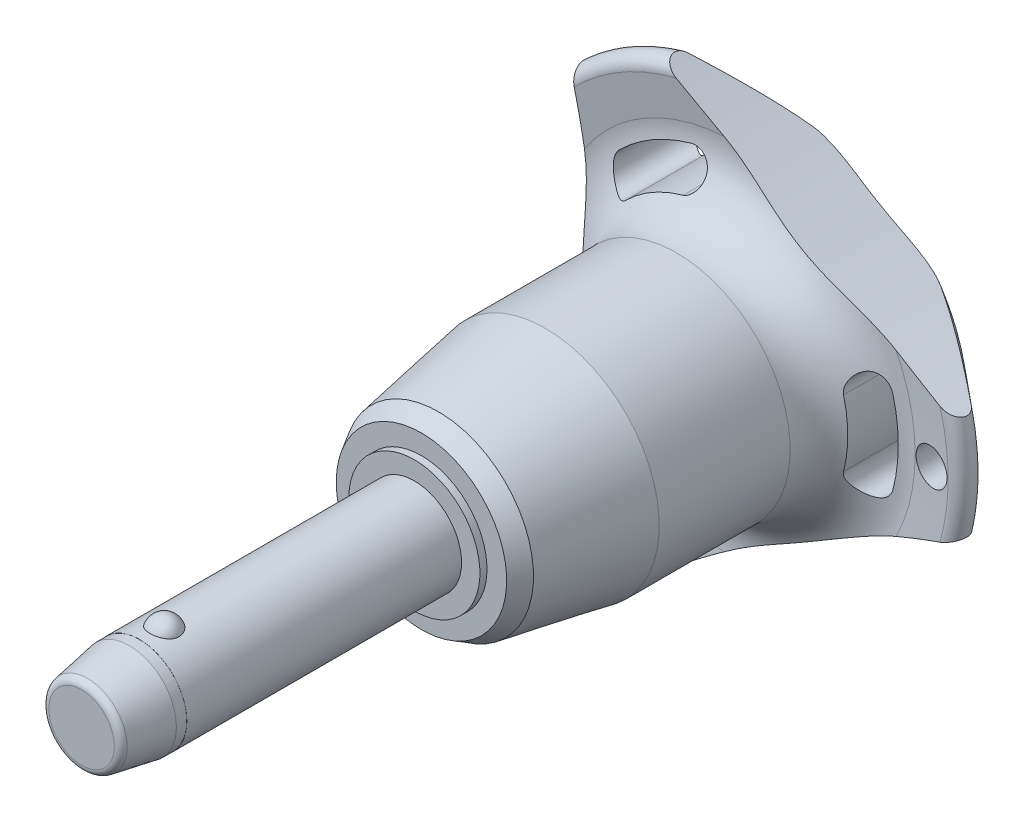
from build123d import *

# Parameters (mm, degrees)
SKETCH1_R           = 4
BOSS_EXTRUDE1_DEPTH = 20
SKETCH2_R           = 3.4
BOSS_EXTRUDE2_DEPTH = 33.3
BOSS_EXTRUDE3_START = 8.2
SKETCH1_2_R         = 4
BOSS_EXTRUDE3_DEPTH = 8.2
CHAMFER1_SIZE       = 4.1
CHAMFER1_SIZE2      = 0.722940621
FILLET1_R           = 0.6
SKETCH6_R           = 102.8
CUT_EXTRUDE1_DEPTH  = 61.079897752
CIRPATTERN1_COUNT   = 3
SKETCH7_R           = 1.5
CUT_EXTRUDE2_DEPTH  = 60.810087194
SKETCH8_R           = 4
SKETCH8_R_2         = 3.99
CUT_EXTRUDE3_DEPTH  = 4.92


with BuildPart() as part:
    # Sketch1 → Boss-Extrude1 (new body)
    with BuildSketch(Plane.XY):
        Circle(SKETCH1_R)
    extrude(amount=-BOSS_EXTRUDE1_DEPTH)

    # Sketch2 → Boss-Extrude2 (add)
    with BuildSketch(Plane(origin=(0, 0, -20), x_dir=(-1, 0, 0), z_dir=(0, 0, -1))):
        Circle(SKETCH2_R)
    extrude(amount=BOSS_EXTRUDE2_DEPTH)

    # Sketch3 → Revolve1 (revolve)
    with BuildSketch(Plane(origin=(0, 0, 0), x_dir=(0, 0, -1), z_dir=(1, 0, 0))):
        with BuildLine():
            Line((-1.2, 4.8), (-1.2, 2.2))
            ThreePointArc((-1.2, 2.2), (0.1, 3.5), (-1.2, 4.8))
        make_face()
        with BuildLine():
            Line((-1.2, -2.2), (-1.2, -4.8))
            ThreePointArc((-1.2, -4.8), (0.1, -3.5), (-1.2, -2.2))
        make_face()
    revolve(axis=Axis((0, -2.2, 1.2), (0, 1, 0)))

    # Sketch1_2 → Boss-Extrude3 (add)
    with BuildSketch(Plane.XY.offset(BOSS_EXTRUDE3_START)):
        Circle(SKETCH1_2_R)
    extrude(amount=-BOSS_EXTRUDE3_DEPTH)

    # Chamfer1
    chamfer1_edges = [part.edges().sort_by_distance(p)[0] for p in [
        (-4, 0, 8.2),
    ]]
    chamfer1_side = [part.faces().sort_by_distance(p)[0] for p in [
        (-4, 0, -5.9),
    ]]
    chamfer(chamfer1_edges, length=CHAMFER1_SIZE, length2=CHAMFER1_SIZE2, reference=chamfer1_side[0])

    # Fillet1
    fillet1_edges = [part.edges().sort_by_distance(p)[0] for p in [
        (-3.277059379, 0, 8.2),
        (3.4, 0, -53.3),
    ]]
    fillet(fillet1_edges, radius=FILLET1_R)

    # Sketch4 → Revolve2 (revolve)
    with BuildSketch(Plane(origin=(0, 0, 0), x_dir=(0, 0, -1), z_dir=(1, 0, 0)), mode=Mode.PRIVATE) as revolve2_sk:
        Polygon((20, 0), (20, 5.554101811), (20.6, 5.554101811), (20.6, 7.220004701), (22.042714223, 8.052956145), (31.1, 9.65), (42.2, 9.65), (42.2, 0), align=None)
    revolve(revolve2_sk.sketch.rotate(Axis((0, 0, -42.2), (0, 0, 1)), 90), axis=Axis((0, 0, -42.2), (0, 0, 1)))

    # Sketch5 → Revolve3 (revolve)
    with BuildSketch(Plane(origin=(0, 0, 0), x_dir=(0, 0, -1), z_dir=(1, 0, 0)), mode=Mode.PRIVATE) as revolve3_sk:
        with BuildLine():
            Line((47.16082631, 15.274661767), (46.757834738, 18.475067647))
            ThreePointArc((46.757834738, 18.475067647), (47.349836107, 19.516443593), (48.516044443, 19.24278761))
            Line((48.516044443, 19.24278761), (52.835691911, 14.094832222))
            ThreePointArc((52.835691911, 14.094832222), (53.3, 12.689260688), (52.67067517, 11.349423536))
            ThreePointArc((52.67067517, 11.349423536), (49.033110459, 6.185112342), (47.75, 0))
            Line((47.75, 0), (42.2, 0))
            Line((42.2, 0), (42.2, 9.65))
            ThreePointArc((42.2, 9.65), (45.949887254, 11.342683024), (47.16082631, 15.274661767))
        make_face()
    revolve(revolve3_sk.sketch.rotate(Axis((0, 0, -47.75), (0, 0, 1)), 90), axis=Axis((0, 0, -47.75), (0, 0, 1)))

    # Sketch6 → Cut-Extrude1 (cut, through all)
    with BuildSketch(Plane.XY):
        with Locations((-115.2, 0)):
            Circle(SKETCH6_R)
        with BuildLine():
            ThreePointArc((13.411913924, -3.529271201), (13.868496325, 0), (13.411913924, 3.529271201))
            ThreePointArc((13.411913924, 3.529271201), (11.694200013, 4.531299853), (10.692171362, 2.813585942))
            ThreePointArc((10.692171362, 2.813585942), (11.056165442, 0), (10.692171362, -2.813585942))
            ThreePointArc((10.692171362, -2.813585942), (11.694200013, -4.531299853), (13.411913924, -3.529271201))
        make_face()
    cut_extrude1 = extrude(amount=-CUT_EXTRUDE1_DEPTH, mode=Mode.SUBTRACT)

    # CirPattern1: Cut-Extrude1 ×3 about axis
    cirpattern1_axis = Axis((0, 0, 0), (0, 0, 1))
    for i in range(1, CIRPATTERN1_COUNT):
        add(cut_extrude1.rotate(cirpattern1_axis, i * 360 / CIRPATTERN1_COUNT), mode=Mode.SUBTRACT)

    # Sketch7 → Cut-Extrude2 (cut, through all)
    with BuildSketch(Plane.XY):
        with Locations(Location((16.868496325, 0, 0), (0, 0, 225.467095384))):
            Circle(SKETCH7_R)
    extrude(amount=-CUT_EXTRUDE2_DEPTH, mode=Mode.SUBTRACT)

    # Sketch8 → Cut-Extrude3 (cut)
    with BuildSketch(Plane.XY.offset(8.2)):
        Circle(SKETCH8_R)
        Circle(SKETCH8_R_2, mode=Mode.SUBTRACT)
    extrude(amount=-CUT_EXTRUDE3_DEPTH, mode=Mode.SUBTRACT)


solid = part.part
